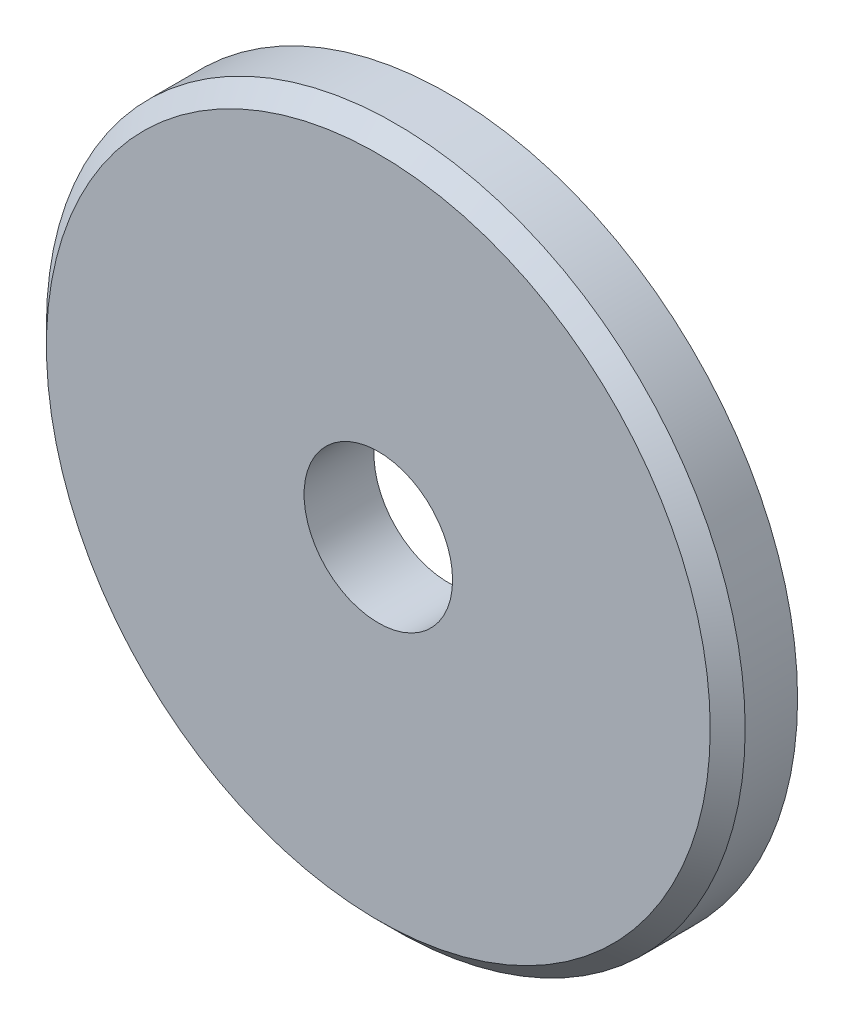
ISO-10303-21;
HEADER;
FILE_DESCRIPTION(('STEP AP214'),'2;1');
FILE_NAME('part.step','',(''),(''),'','','');
FILE_SCHEMA(('AUTOMOTIVE_DESIGN { 1 0 10303 214 1 1 1 1 }'));
ENDSEC;
DATA;
#1=APPLICATION_CONTEXT('core data for automotive mechanical design processes');
#2=APPLICATION_PROTOCOL_DEFINITION('international standard','automotive_design',2000,#1);
#3=PRODUCT_CONTEXT('',#1,'mechanical');
#4=PRODUCT('Part','Part','',(#3));
#5=PRODUCT_RELATED_PRODUCT_CATEGORY('part','',(#4));
#6=PRODUCT_DEFINITION_FORMATION('','',#4);
#7=PRODUCT_DEFINITION_CONTEXT('part definition',#1,'design');
#8=PRODUCT_DEFINITION('design','',#6,#7);
#9=PRODUCT_DEFINITION_SHAPE('','',#8);
#10=(LENGTH_UNIT() NAMED_UNIT(*) SI_UNIT(.MILLI.,.METRE.));
#11=(NAMED_UNIT(*) PLANE_ANGLE_UNIT() SI_UNIT($,.RADIAN.));
#12=(NAMED_UNIT(*) SI_UNIT($,.STERADIAN.) SOLID_ANGLE_UNIT());
#13=UNCERTAINTY_MEASURE_WITH_UNIT(LENGTH_MEASURE(1.E-05),#10,'distance_accuracy_value','');
#14=(GEOMETRIC_REPRESENTATION_CONTEXT(3) GLOBAL_UNCERTAINTY_ASSIGNED_CONTEXT((#13)) GLOBAL_UNIT_ASSIGNED_CONTEXT((#10,
#11,#12)) REPRESENTATION_CONTEXT('',''));
#15=CARTESIAN_POINT('',(0.,0.,0.));
#16=DIRECTION('',(0.,0.,1.));
#17=DIRECTION('',(1.,0.,0.));
#18=AXIS2_PLACEMENT_3D('',#15,#16,#17);
#19=CARTESIAN_POINT('',(0.,0.,7.99999999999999));
#20=DIRECTION('',(0.,0.,1.));
#21=DIRECTION('',(1.,0.,0.));
#22=AXIS2_PLACEMENT_3D('',#19,#20,#21);
#23=PLANE('',#22);
#24=CARTESIAN_POINT('',(0.,0.,7.99999999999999));
#25=DIRECTION('',(0.,0.,1.));
#26=DIRECTION('',(1.,0.,0.));
#27=AXIS2_PLACEMENT_3D('',#24,#25,#26);
#28=CIRCLE('',#27,38.);
#29=CARTESIAN_POINT('',(38.,0.,7.99999999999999));
#30=VERTEX_POINT('',#29);
#31=EDGE_CURVE('E33',#30,#30,#28,.T.);
#32=ORIENTED_EDGE('',*,*,#31,.T.);
#33=EDGE_LOOP('',(#32));
#34=FACE_BOUND('',#33,.T.);
#35=CARTESIAN_POINT('',(0.,0.,7.99999999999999));
#36=DIRECTION('',(0.,0.,1.));
#37=DIRECTION('',(1.,0.,0.));
#38=AXIS2_PLACEMENT_3D('',#35,#36,#37);
#39=CIRCLE('',#38,8.5);
#40=CARTESIAN_POINT('',(8.5,0.,7.99999999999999));
#41=VERTEX_POINT('',#40);
#42=EDGE_CURVE('E41',#41,#41,#39,.T.);
#43=ORIENTED_EDGE('',*,*,#42,.F.);
#44=EDGE_LOOP('',(#43));
#45=FACE_BOUND('',#44,.T.);
#46=ADVANCED_FACE('F26',(#34,#45),#23,.T.);
#47=CARTESIAN_POINT('',(0.,0.,0.));
#48=DIRECTION('',(0.,0.,1.));
#49=DIRECTION('',(1.,0.,0.));
#50=AXIS2_PLACEMENT_3D('',#47,#48,#49);
#51=PLANE('',#50);
#52=CARTESIAN_POINT('',(0.,0.,0.));
#53=DIRECTION('',(0.,0.,1.));
#54=DIRECTION('',(1.,0.,0.));
#55=AXIS2_PLACEMENT_3D('',#52,#53,#54);
#56=CIRCLE('',#55,40.);
#57=CARTESIAN_POINT('',(40.,0.,0.));
#58=VERTEX_POINT('',#57);
#59=EDGE_CURVE('E37',#58,#58,#56,.T.);
#60=ORIENTED_EDGE('',*,*,#59,.F.);
#61=EDGE_LOOP('',(#60));
#62=FACE_BOUND('',#61,.T.);
#63=CARTESIAN_POINT('',(0.,0.,0.));
#64=DIRECTION('',(0.,0.,1.));
#65=DIRECTION('',(1.,0.,0.));
#66=AXIS2_PLACEMENT_3D('',#63,#64,#65);
#67=CIRCLE('',#66,8.5);
#68=CARTESIAN_POINT('',(8.5,0.,0.));
#69=VERTEX_POINT('',#68);
#70=EDGE_CURVE('E46',#69,#69,#67,.T.);
#71=ORIENTED_EDGE('',*,*,#70,.T.);
#72=EDGE_LOOP('',(#71));
#73=FACE_BOUND('',#72,.T.);
#74=ADVANCED_FACE('F50',(#62,#73),#51,.F.);
#75=CARTESIAN_POINT('',(0.,0.,7.99999999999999));
#76=DIRECTION('',(0.,0.,-1.));
#77=DIRECTION('',(-1.,0.,0.));
#78=AXIS2_PLACEMENT_3D('',#75,#76,#77);
#79=CYLINDRICAL_SURFACE('',#78,40.);
#80=CARTESIAN_POINT('',(0.,0.,5.99999999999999));
#81=DIRECTION('',(0.,0.,1.));
#82=DIRECTION('',(1.,0.,0.));
#83=AXIS2_PLACEMENT_3D('',#80,#81,#82);
#84=CIRCLE('',#83,40.);
#85=CARTESIAN_POINT('',(40.,0.,5.99999999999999));
#86=VERTEX_POINT('',#85);
#87=EDGE_CURVE('E10',#86,#86,#84,.F.);
#88=ORIENTED_EDGE('',*,*,#87,.T.);
#89=EDGE_LOOP('',(#88));
#90=FACE_BOUND('',#89,.T.);
#91=ORIENTED_EDGE('',*,*,#59,.T.);
#92=EDGE_LOOP('',(#91));
#93=FACE_BOUND('',#92,.T.);
#94=ADVANCED_FACE('F28',(#90,#93),#79,.T.);
#95=CARTESIAN_POINT('',(0.,0.,7.99999999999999));
#96=DIRECTION('',(0.,0.,-1.));
#97=DIRECTION('',(-1.,0.,0.));
#98=AXIS2_PLACEMENT_3D('',#95,#96,#97);
#99=CYLINDRICAL_SURFACE('',#98,8.5);
#100=ORIENTED_EDGE('',*,*,#42,.T.);
#101=EDGE_LOOP('',(#100));
#102=FACE_BOUND('',#101,.T.);
#103=ORIENTED_EDGE('',*,*,#70,.F.);
#104=EDGE_LOOP('',(#103));
#105=FACE_BOUND('',#104,.T.);
#106=ADVANCED_FACE('F52',(#102,#105),#99,.F.);
#107=CARTESIAN_POINT('',(0.,0.,7.99999999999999));
#108=DIRECTION('',(0.,0.,-1.));
#109=DIRECTION('',(-1.,0.,0.));
#110=AXIS2_PLACEMENT_3D('',#107,#108,#109);
#111=CONICAL_SURFACE('',#110,38.,0.785398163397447);
#112=ORIENTED_EDGE('',*,*,#87,.F.);
#113=EDGE_LOOP('',(#112));
#114=FACE_BOUND('',#113,.T.);
#115=ORIENTED_EDGE('',*,*,#31,.F.);
#116=EDGE_LOOP('',(#115));
#117=FACE_BOUND('',#116,.T.);
#118=ADVANCED_FACE('F54',(#114,#117),#111,.T.);
#119=CLOSED_SHELL('',(#46,#74,#94,#106,#118));
#120=MANIFOLD_SOLID_BREP('B2',#119);
#121=ADVANCED_BREP_SHAPE_REPRESENTATION('',(#18,#120),#14);
#122=SHAPE_DEFINITION_REPRESENTATION(#9,#121);
ENDSEC;
END-ISO-10303-21;
